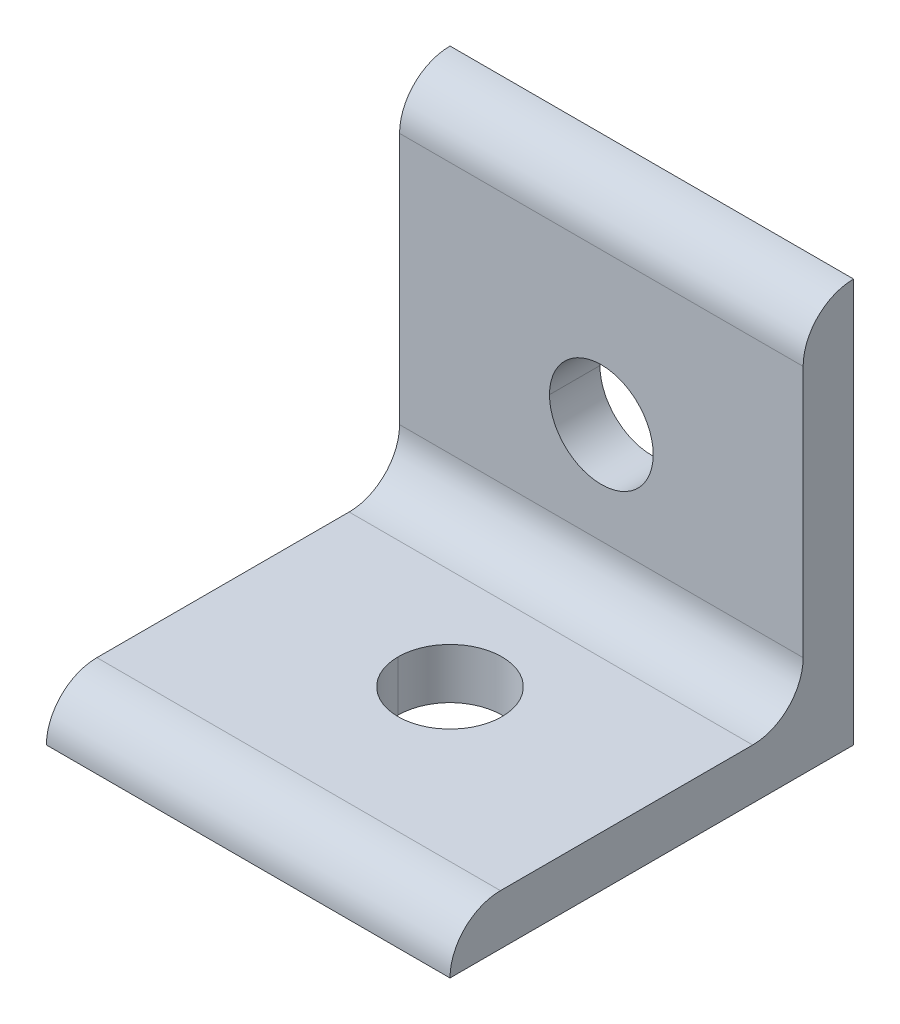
ISO-10303-21;
HEADER;
FILE_DESCRIPTION(('STEP AP214'),'2;1');
FILE_NAME('part.step','',(''),(''),'','','');
FILE_SCHEMA(('AUTOMOTIVE_DESIGN { 1 0 10303 214 1 1 1 1 }'));
ENDSEC;
DATA;
#1=APPLICATION_CONTEXT('core data for automotive mechanical design processes');
#2=APPLICATION_PROTOCOL_DEFINITION('international standard','automotive_design',2000,#1);
#3=PRODUCT_CONTEXT('',#1,'mechanical');
#4=PRODUCT('Part','Part','',(#3));
#5=PRODUCT_RELATED_PRODUCT_CATEGORY('part','',(#4));
#6=PRODUCT_DEFINITION_FORMATION('','',#4);
#7=PRODUCT_DEFINITION_CONTEXT('part definition',#1,'design');
#8=PRODUCT_DEFINITION('design','',#6,#7);
#9=PRODUCT_DEFINITION_SHAPE('','',#8);
#10=(LENGTH_UNIT() NAMED_UNIT(*) SI_UNIT(.MILLI.,.METRE.));
#11=(NAMED_UNIT(*) PLANE_ANGLE_UNIT() SI_UNIT($,.RADIAN.));
#12=(NAMED_UNIT(*) SI_UNIT($,.STERADIAN.) SOLID_ANGLE_UNIT());
#13=UNCERTAINTY_MEASURE_WITH_UNIT(LENGTH_MEASURE(1.E-05),#10,'distance_accuracy_value','');
#14=(GEOMETRIC_REPRESENTATION_CONTEXT(3) GLOBAL_UNCERTAINTY_ASSIGNED_CONTEXT((#13)) GLOBAL_UNIT_ASSIGNED_CONTEXT((#10,
#11,#12)) REPRESENTATION_CONTEXT('',''));
#15=CARTESIAN_POINT('',(0.,0.,0.));
#16=DIRECTION('',(0.,0.,1.));
#17=DIRECTION('',(1.,0.,0.));
#18=AXIS2_PLACEMENT_3D('',#15,#16,#17);
#19=CARTESIAN_POINT('',(12.7,3.175,6.35));
#20=DIRECTION('',(0.,-1.,0.));
#21=DIRECTION('',(0.,0.,-1.));
#22=AXIS2_PLACEMENT_3D('',#19,#20,#21);
#23=PLANE('',#22);
#24=CARTESIAN_POINT('',(0.,3.175,12.7));
#25=DIRECTION('',(0.,1.,0.));
#26=DIRECTION('',(1.,0.,0.));
#27=AXIS2_PLACEMENT_3D('',#24,#25,#26);
#28=CIRCLE('',#27,3.2639);
#29=CARTESIAN_POINT('',(3.2639,3.175,12.7));
#30=VERTEX_POINT('',#29);
#31=CARTESIAN_POINT('',(-3.2639,3.175,12.7));
#32=VERTEX_POINT('',#31);
#33=EDGE_CURVE('E11',#30,#32,#28,.T.);
#34=ORIENTED_EDGE('',*,*,#33,.F.);
#35=CARTESIAN_POINT('',(0.,3.175,12.7));
#36=DIRECTION('',(0.,1.,0.));
#37=DIRECTION('',(1.,0.,0.));
#38=AXIS2_PLACEMENT_3D('',#35,#36,#37);
#39=CIRCLE('',#38,3.2639);
#40=EDGE_CURVE('E25',#32,#30,#39,.T.);
#41=ORIENTED_EDGE('',*,*,#40,.F.);
#42=EDGE_LOOP('',(#34,#41));
#43=FACE_BOUND('',#42,.T.);
#44=DIRECTION('',(0.,0.,1.));
#45=VECTOR('',#44,1.);
#46=CARTESIAN_POINT('',(-12.7,3.175,6.35));
#47=LINE('',#46,#45);
#48=CARTESIAN_POINT('',(-12.7,3.175,6.34999999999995));
#49=VERTEX_POINT('',#48);
#50=CARTESIAN_POINT('',(-12.7,3.175,22.225));
#51=VERTEX_POINT('',#50);
#52=EDGE_CURVE('E220',#49,#51,#47,.T.);
#53=ORIENTED_EDGE('',*,*,#52,.T.);
#54=DIRECTION('',(-1.,0.,0.));
#55=VECTOR('',#54,1.);
#56=CARTESIAN_POINT('',(12.7,3.175,22.225));
#57=LINE('',#56,#55);
#58=CARTESIAN_POINT('',(12.7,3.175,22.225));
#59=VERTEX_POINT('',#58);
#60=EDGE_CURVE('E111',#59,#51,#57,.T.);
#61=ORIENTED_EDGE('',*,*,#60,.F.);
#62=DIRECTION('',(0.,0.,1.));
#63=VECTOR('',#62,1.);
#64=CARTESIAN_POINT('',(12.7,3.175,6.35));
#65=LINE('',#64,#63);
#66=CARTESIAN_POINT('',(12.7,3.175,6.34999999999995));
#67=VERTEX_POINT('',#66);
#68=EDGE_CURVE('E212',#67,#59,#65,.T.);
#69=ORIENTED_EDGE('',*,*,#68,.F.);
#70=DIRECTION('',(-1.,0.,0.));
#71=VECTOR('',#70,1.);
#72=CARTESIAN_POINT('',(12.7,3.175,6.34999999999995));
#73=LINE('',#72,#71);
#74=EDGE_CURVE('E208',#67,#49,#73,.T.);
#75=ORIENTED_EDGE('',*,*,#74,.T.);
#76=EDGE_LOOP('',(#53,#61,#69,#75));
#77=FACE_BOUND('',#76,.T.);
#78=ADVANCED_FACE('F17',(#43,#77),#23,.F.);
#79=CARTESIAN_POINT('',(12.7,6.34999999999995,6.34999999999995));
#80=DIRECTION('',(1.,0.,0.));
#81=DIRECTION('',(0.,0.707106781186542,0.707106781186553));
#82=AXIS2_PLACEMENT_3D('',#79,#80,#81);
#83=CYLINDRICAL_SURFACE('',#82,3.17499999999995);
#84=DIRECTION('',(-1.,0.,0.));
#85=VECTOR('',#84,1.);
#86=CARTESIAN_POINT('',(12.7,6.35,3.175));
#87=LINE('',#86,#85);
#88=CARTESIAN_POINT('',(12.7,6.35,3.175));
#89=VERTEX_POINT('',#88);
#90=CARTESIAN_POINT('',(-12.7,6.35,3.175));
#91=VERTEX_POINT('',#90);
#92=EDGE_CURVE('E204',#89,#91,#87,.T.);
#93=ORIENTED_EDGE('',*,*,#92,.T.);
#94=CARTESIAN_POINT('',(-12.7,6.34999999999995,6.34999999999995));
#95=DIRECTION('',(1.,0.,0.));
#96=DIRECTION('',(0.,0.,-1.));
#97=AXIS2_PLACEMENT_3D('',#94,#95,#96);
#98=CIRCLE('',#97,3.17499999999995);
#99=EDGE_CURVE('E199',#49,#91,#98,.T.);
#100=ORIENTED_EDGE('',*,*,#99,.F.);
#101=ORIENTED_EDGE('',*,*,#74,.F.);
#102=CARTESIAN_POINT('',(12.7,6.34999999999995,6.34999999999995));
#103=DIRECTION('',(1.,0.,0.));
#104=DIRECTION('',(0.,0.,-1.));
#105=AXIS2_PLACEMENT_3D('',#102,#103,#104);
#106=CIRCLE('',#105,3.17499999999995);
#107=EDGE_CURVE('E195',#67,#89,#106,.T.);
#108=ORIENTED_EDGE('',*,*,#107,.T.);
#109=EDGE_LOOP('',(#93,#100,#101,#108));
#110=FACE_BOUND('',#109,.T.);
#111=ADVANCED_FACE('F307',(#110),#83,.F.);
#112=CARTESIAN_POINT('',(12.7,-4.70110061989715E-13,22.2249999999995));
#113=DIRECTION('',(1.,0.,0.));
#114=DIRECTION('',(0.,0.,-1.));
#115=AXIS2_PLACEMENT_3D('',#112,#113,#114);
#116=PLANE('',#115);
#117=CARTESIAN_POINT('',(12.7,-4.70110061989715E-13,22.2249999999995));
#118=DIRECTION('',(1.,0.,0.));
#119=DIRECTION('',(0.,0.,-1.));
#120=AXIS2_PLACEMENT_3D('',#117,#118,#119);
#121=CIRCLE('',#120,3.17500000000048);
#122=CARTESIAN_POINT('',(12.7,0.,25.4));
#123=VERTEX_POINT('',#122);
#124=EDGE_CURVE('E191',#59,#123,#121,.T.);
#125=ORIENTED_EDGE('',*,*,#124,.T.);
#126=DIRECTION('',(0.,0.,-1.));
#127=VECTOR('',#126,1.);
#128=CARTESIAN_POINT('',(12.7,0.,25.4));
#129=LINE('',#128,#127);
#130=CARTESIAN_POINT('',(12.7,0.,0.));
#131=VERTEX_POINT('',#130);
#132=EDGE_CURVE('E103',#123,#131,#129,.T.);
#133=ORIENTED_EDGE('',*,*,#132,.T.);
#134=DIRECTION('',(0.,1.,0.));
#135=VECTOR('',#134,1.);
#136=CARTESIAN_POINT('',(12.7,0.,0.));
#137=LINE('',#136,#135);
#138=CARTESIAN_POINT('',(12.7,25.4,0.));
#139=VERTEX_POINT('',#138);
#140=EDGE_CURVE('E184',#131,#139,#137,.T.);
#141=ORIENTED_EDGE('',*,*,#140,.T.);
#142=CARTESIAN_POINT('',(12.7,22.2249999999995,-4.69459540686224E-13));
#143=DIRECTION('',(1.,0.,0.));
#144=DIRECTION('',(0.,0.,-1.));
#145=AXIS2_PLACEMENT_3D('',#142,#143,#144);
#146=CIRCLE('',#145,3.17500000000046);
#147=CARTESIAN_POINT('',(12.7,22.2249999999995,3.175));
#148=VERTEX_POINT('',#147);
#149=EDGE_CURVE('E180',#139,#148,#146,.T.);
#150=ORIENTED_EDGE('',*,*,#149,.T.);
#151=DIRECTION('',(0.,-1.,0.));
#152=VECTOR('',#151,1.);
#153=CARTESIAN_POINT('',(12.7,22.225,3.175));
#154=LINE('',#153,#152);
#155=EDGE_CURVE('E175',#148,#89,#154,.T.);
#156=ORIENTED_EDGE('',*,*,#155,.T.);
#157=ORIENTED_EDGE('',*,*,#107,.F.);
#158=ORIENTED_EDGE('',*,*,#68,.T.);
#159=EDGE_LOOP('',(#125,#133,#141,#150,#156,#157,#158));
#160=FACE_BOUND('',#159,.T.);
#161=ADVANCED_FACE('F304',(#160),#116,.T.);
#162=CARTESIAN_POINT('',(12.7,22.225,3.175));
#163=DIRECTION('',(0.,0.,-1.));
#164=DIRECTION('',(-1.,0.,0.));
#165=AXIS2_PLACEMENT_3D('',#162,#163,#164);
#166=PLANE('',#165);
#167=CARTESIAN_POINT('',(0.,12.7,3.175));
#168=DIRECTION('',(0.,0.,1.));
#169=DIRECTION('',(1.,0.,0.));
#170=AXIS2_PLACEMENT_3D('',#167,#168,#169);
#171=CIRCLE('',#170,3.2639);
#172=CARTESIAN_POINT('',(3.2639,12.7,3.175));
#173=VERTEX_POINT('',#172);
#174=CARTESIAN_POINT('',(-3.2639,12.7,3.175));
#175=VERTEX_POINT('',#174);
#176=EDGE_CURVE('E170',#173,#175,#171,.T.);
#177=ORIENTED_EDGE('',*,*,#176,.F.);
#178=CARTESIAN_POINT('',(0.,12.7,3.175));
#179=DIRECTION('',(0.,0.,1.));
#180=DIRECTION('',(1.,0.,0.));
#181=AXIS2_PLACEMENT_3D('',#178,#179,#180);
#182=CIRCLE('',#181,3.2639);
#183=EDGE_CURVE('E165',#175,#173,#182,.T.);
#184=ORIENTED_EDGE('',*,*,#183,.F.);
#185=EDGE_LOOP('',(#177,#184));
#186=FACE_BOUND('',#185,.T.);
#187=DIRECTION('',(0.,-1.,0.));
#188=VECTOR('',#187,1.);
#189=CARTESIAN_POINT('',(-12.7,22.225,3.175));
#190=LINE('',#189,#188);
#191=CARTESIAN_POINT('',(-12.7,22.2249999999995,3.175));
#192=VERTEX_POINT('',#191);
#193=EDGE_CURVE('E160',#192,#91,#190,.T.);
#194=ORIENTED_EDGE('',*,*,#193,.T.);
#195=ORIENTED_EDGE('',*,*,#92,.F.);
#196=ORIENTED_EDGE('',*,*,#155,.F.);
#197=DIRECTION('',(-1.,0.,0.));
#198=VECTOR('',#197,1.);
#199=CARTESIAN_POINT('',(12.7,22.2249999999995,3.175));
#200=LINE('',#199,#198);
#201=EDGE_CURVE('E156',#148,#192,#200,.T.);
#202=ORIENTED_EDGE('',*,*,#201,.T.);
#203=EDGE_LOOP('',(#194,#195,#196,#202));
#204=FACE_BOUND('',#203,.T.);
#205=ADVANCED_FACE('F300',(#186,#204),#166,.F.);
#206=CARTESIAN_POINT('',(12.7,22.2249999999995,-4.69459540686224E-13));
#207=DIRECTION('',(1.,0.,0.));
#208=DIRECTION('',(0.,-0.707106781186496,-0.7071067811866));
#209=AXIS2_PLACEMENT_3D('',#206,#207,#208);
#210=CYLINDRICAL_SURFACE('',#209,3.17500000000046);
#211=CARTESIAN_POINT('',(-12.7,22.2249999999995,-4.69459540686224E-13));
#212=DIRECTION('',(1.,0.,0.));
#213=DIRECTION('',(0.,0.,-1.));
#214=AXIS2_PLACEMENT_3D('',#211,#212,#213);
#215=CIRCLE('',#214,3.17500000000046);
#216=CARTESIAN_POINT('',(-12.7,25.4,0.));
#217=VERTEX_POINT('',#216);
#218=EDGE_CURVE('E151',#217,#192,#215,.T.);
#219=ORIENTED_EDGE('',*,*,#218,.T.);
#220=ORIENTED_EDGE('',*,*,#201,.F.);
#221=ORIENTED_EDGE('',*,*,#149,.F.);
#222=DIRECTION('',(-1.,0.,0.));
#223=VECTOR('',#222,1.);
#224=CARTESIAN_POINT('',(12.7,25.4,0.));
#225=LINE('',#224,#223);
#226=EDGE_CURVE('E147',#139,#217,#225,.T.);
#227=ORIENTED_EDGE('',*,*,#226,.T.);
#228=EDGE_LOOP('',(#219,#220,#221,#227));
#229=FACE_BOUND('',#228,.T.);
#230=ADVANCED_FACE('F296',(#229),#210,.T.);
#231=CARTESIAN_POINT('',(12.7,0.,0.));
#232=DIRECTION('',(0.,0.,1.));
#233=DIRECTION('',(1.,0.,0.));
#234=AXIS2_PLACEMENT_3D('',#231,#232,#233);
#235=PLANE('',#234);
#236=CARTESIAN_POINT('',(0.,12.7,0.));
#237=DIRECTION('',(0.,0.,1.));
#238=DIRECTION('',(1.,0.,0.));
#239=AXIS2_PLACEMENT_3D('',#236,#237,#238);
#240=CIRCLE('',#239,3.2639);
#241=CARTESIAN_POINT('',(3.2639,12.7,0.));
#242=VERTEX_POINT('',#241);
#243=CARTESIAN_POINT('',(-3.2639,12.7,0.));
#244=VERTEX_POINT('',#243);
#245=EDGE_CURVE('E143',#242,#244,#240,.T.);
#246=ORIENTED_EDGE('',*,*,#245,.T.);
#247=CARTESIAN_POINT('',(0.,12.7,0.));
#248=DIRECTION('',(0.,0.,1.));
#249=DIRECTION('',(1.,0.,0.));
#250=AXIS2_PLACEMENT_3D('',#247,#248,#249);
#251=CIRCLE('',#250,3.2639);
#252=EDGE_CURVE('E139',#244,#242,#251,.T.);
#253=ORIENTED_EDGE('',*,*,#252,.T.);
#254=EDGE_LOOP('',(#246,#253));
#255=FACE_BOUND('',#254,.T.);
#256=DIRECTION('',(0.,1.,0.));
#257=VECTOR('',#256,1.);
#258=CARTESIAN_POINT('',(-12.7,0.,0.));
#259=LINE('',#258,#257);
#260=CARTESIAN_POINT('',(-12.7,0.,0.));
#261=VERTEX_POINT('',#260);
#262=EDGE_CURVE('E119',#261,#217,#259,.T.);
#263=ORIENTED_EDGE('',*,*,#262,.T.);
#264=ORIENTED_EDGE('',*,*,#226,.F.);
#265=ORIENTED_EDGE('',*,*,#140,.F.);
#266=DIRECTION('',(-1.,0.,0.));
#267=VECTOR('',#266,1.);
#268=CARTESIAN_POINT('',(12.7,0.,0.));
#269=LINE('',#268,#267);
#270=EDGE_CURVE('E132',#131,#261,#269,.T.);
#271=ORIENTED_EDGE('',*,*,#270,.T.);
#272=EDGE_LOOP('',(#263,#264,#265,#271));
#273=FACE_BOUND('',#272,.T.);
#274=ADVANCED_FACE('F292',(#255,#273),#235,.F.);
#275=CARTESIAN_POINT('',(12.7,0.,25.4));
#276=DIRECTION('',(0.,1.,0.));
#277=DIRECTION('',(0.,0.,1.));
#278=AXIS2_PLACEMENT_3D('',#275,#276,#277);
#279=PLANE('',#278);
#280=CARTESIAN_POINT('',(0.,0.,12.7));
#281=DIRECTION('',(0.,1.,0.));
#282=DIRECTION('',(1.,0.,0.));
#283=AXIS2_PLACEMENT_3D('',#280,#281,#282);
#284=CIRCLE('',#283,3.2639);
#285=CARTESIAN_POINT('',(3.2639,0.,12.7));
#286=VERTEX_POINT('',#285);
#287=CARTESIAN_POINT('',(-3.2639,0.,12.7));
#288=VERTEX_POINT('',#287);
#289=EDGE_CURVE('E122',#286,#288,#284,.T.);
#290=ORIENTED_EDGE('',*,*,#289,.T.);
#291=CARTESIAN_POINT('',(0.,0.,12.7));
#292=DIRECTION('',(0.,1.,0.));
#293=DIRECTION('',(1.,0.,0.));
#294=AXIS2_PLACEMENT_3D('',#291,#292,#293);
#295=CIRCLE('',#294,3.2639);
#296=EDGE_CURVE('E120',#288,#286,#295,.T.);
#297=ORIENTED_EDGE('',*,*,#296,.T.);
#298=EDGE_LOOP('',(#290,#297));
#299=FACE_BOUND('',#298,.T.);
#300=DIRECTION('',(0.,0.,-1.));
#301=VECTOR('',#300,1.);
#302=CARTESIAN_POINT('',(-12.7,0.,25.4));
#303=LINE('',#302,#301);
#304=CARTESIAN_POINT('',(-12.7,0.,25.4));
#305=VERTEX_POINT('',#304);
#306=EDGE_CURVE('E101',#305,#261,#303,.T.);
#307=ORIENTED_EDGE('',*,*,#306,.T.);
#308=ORIENTED_EDGE('',*,*,#270,.F.);
#309=ORIENTED_EDGE('',*,*,#132,.F.);
#310=DIRECTION('',(-1.,0.,0.));
#311=VECTOR('',#310,1.);
#312=CARTESIAN_POINT('',(12.7,0.,25.4));
#313=LINE('',#312,#311);
#314=EDGE_CURVE('E96',#123,#305,#313,.T.);
#315=ORIENTED_EDGE('',*,*,#314,.T.);
#316=EDGE_LOOP('',(#307,#308,#309,#315));
#317=FACE_BOUND('',#316,.T.);
#318=ADVANCED_FACE('F98',(#299,#317),#279,.F.);
#319=CARTESIAN_POINT('',(12.7,-4.70110061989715E-13,22.2249999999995));
#320=DIRECTION('',(1.,0.,0.));
#321=DIRECTION('',(0.,-0.707106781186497,-0.707106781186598));
#322=AXIS2_PLACEMENT_3D('',#319,#320,#321);
#323=CYLINDRICAL_SURFACE('',#322,3.17500000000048);
#324=CARTESIAN_POINT('',(-12.7,-4.70110061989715E-13,22.2249999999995));
#325=DIRECTION('',(1.,0.,0.));
#326=DIRECTION('',(0.,0.,-1.));
#327=AXIS2_PLACEMENT_3D('',#324,#325,#326);
#328=CIRCLE('',#327,3.17500000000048);
#329=EDGE_CURVE('E106',#51,#305,#328,.T.);
#330=ORIENTED_EDGE('',*,*,#329,.T.);
#331=ORIENTED_EDGE('',*,*,#314,.F.);
#332=ORIENTED_EDGE('',*,*,#124,.F.);
#333=ORIENTED_EDGE('',*,*,#60,.T.);
#334=EDGE_LOOP('',(#330,#331,#332,#333));
#335=FACE_BOUND('',#334,.T.);
#336=ADVANCED_FACE('F110',(#335),#323,.T.);
#337=CARTESIAN_POINT('',(-12.7,-4.70110061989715E-13,22.2249999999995));
#338=DIRECTION('',(1.,0.,0.));
#339=DIRECTION('',(0.,0.,-1.));
#340=AXIS2_PLACEMENT_3D('',#337,#338,#339);
#341=PLANE('',#340);
#342=ORIENTED_EDGE('',*,*,#329,.F.);
#343=ORIENTED_EDGE('',*,*,#52,.F.);
#344=ORIENTED_EDGE('',*,*,#99,.T.);
#345=ORIENTED_EDGE('',*,*,#193,.F.);
#346=ORIENTED_EDGE('',*,*,#218,.F.);
#347=ORIENTED_EDGE('',*,*,#262,.F.);
#348=ORIENTED_EDGE('',*,*,#306,.F.);
#349=EDGE_LOOP('',(#342,#343,#344,#345,#346,#347,#348));
#350=FACE_BOUND('',#349,.T.);
#351=ADVANCED_FACE('F116',(#350),#341,.F.);
#352=CARTESIAN_POINT('',(0.,3.175,12.7));
#353=DIRECTION('',(0.,1.,0.));
#354=DIRECTION('',(0.,0.,-1.));
#355=AXIS2_PLACEMENT_3D('',#352,#353,#354);
#356=CYLINDRICAL_SURFACE('',#355,3.2639);
#357=ORIENTED_EDGE('',*,*,#296,.F.);
#358=CARTESIAN_POINT('',(-3.2639,0.,12.7));
#359=DIRECTION('',(0.,1.,0.));
#360=VECTOR('',#359,1.);
#361=LINE('',#358,#360);
#362=EDGE_CURVE('E114',#288,#32,#361,.T.);
#363=ORIENTED_EDGE('',*,*,#362,.T.);
#364=ORIENTED_EDGE('',*,*,#40,.T.);
#365=CARTESIAN_POINT('',(3.2639,0.,12.7));
#366=DIRECTION('',(0.,1.,0.));
#367=VECTOR('',#366,1.);
#368=LINE('',#365,#367);
#369=EDGE_CURVE('E233',#286,#30,#368,.T.);
#370=ORIENTED_EDGE('',*,*,#369,.F.);
#371=EDGE_LOOP('',(#357,#363,#364,#370));
#372=FACE_BOUND('',#371,.T.);
#373=ADVANCED_FACE('F232',(#372),#356,.F.);
#374=CARTESIAN_POINT('',(0.,3.175,12.7));
#375=DIRECTION('',(0.,1.,0.));
#376=DIRECTION('',(0.,0.,1.));
#377=AXIS2_PLACEMENT_3D('',#374,#375,#376);
#378=CYLINDRICAL_SURFACE('',#377,3.2639);
#379=ORIENTED_EDGE('',*,*,#33,.T.);
#380=ORIENTED_EDGE('',*,*,#362,.F.);
#381=ORIENTED_EDGE('',*,*,#289,.F.);
#382=ORIENTED_EDGE('',*,*,#369,.T.);
#383=EDGE_LOOP('',(#379,#380,#381,#382));
#384=FACE_BOUND('',#383,.T.);
#385=ADVANCED_FACE('F240',(#384),#378,.F.);
#386=CARTESIAN_POINT('',(0.,12.7,3.175));
#387=DIRECTION('',(0.,0.,1.));
#388=DIRECTION('',(0.,1.,0.));
#389=AXIS2_PLACEMENT_3D('',#386,#387,#388);
#390=CYLINDRICAL_SURFACE('',#389,3.2639);
#391=ORIENTED_EDGE('',*,*,#252,.F.);
#392=CARTESIAN_POINT('',(-3.2639,12.7,0.));
#393=DIRECTION('',(0.,0.,1.));
#394=VECTOR('',#393,1.);
#395=LINE('',#392,#394);
#396=EDGE_CURVE('E241',#244,#175,#395,.T.);
#397=ORIENTED_EDGE('',*,*,#396,.T.);
#398=ORIENTED_EDGE('',*,*,#183,.T.);
#399=CARTESIAN_POINT('',(3.2639,12.7,0.));
#400=DIRECTION('',(0.,0.,1.));
#401=VECTOR('',#400,1.);
#402=LINE('',#399,#401);
#403=EDGE_CURVE('E462',#242,#173,#402,.T.);
#404=ORIENTED_EDGE('',*,*,#403,.F.);
#405=EDGE_LOOP('',(#391,#397,#398,#404));
#406=FACE_BOUND('',#405,.T.);
#407=ADVANCED_FACE('F261',(#406),#390,.F.);
#408=CARTESIAN_POINT('',(0.,12.7,3.175));
#409=DIRECTION('',(0.,0.,1.));
#410=DIRECTION('',(0.,-1.,0.));
#411=AXIS2_PLACEMENT_3D('',#408,#409,#410);
#412=CYLINDRICAL_SURFACE('',#411,3.2639);
#413=ORIENTED_EDGE('',*,*,#176,.T.);
#414=ORIENTED_EDGE('',*,*,#396,.F.);
#415=ORIENTED_EDGE('',*,*,#245,.F.);
#416=ORIENTED_EDGE('',*,*,#403,.T.);
#417=EDGE_LOOP('',(#413,#414,#415,#416));
#418=FACE_BOUND('',#417,.T.);
#419=ADVANCED_FACE('F401',(#418),#412,.F.);
#420=CLOSED_SHELL('',(#78,#111,#161,#205,#230,#274,#318,#336,#351,#373,#385,#407,#419));
#421=MANIFOLD_SOLID_BREP('B1',#420);
#422=ADVANCED_BREP_SHAPE_REPRESENTATION('',(#18,#421),#14);
#423=SHAPE_DEFINITION_REPRESENTATION(#9,#422);
ENDSEC;
END-ISO-10303-21;
